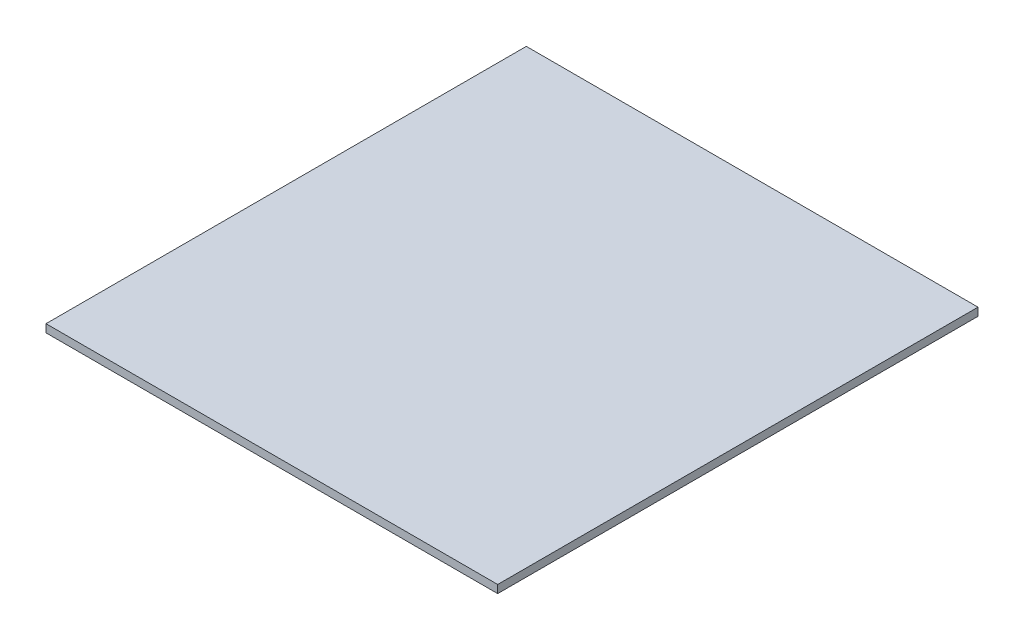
ISO-10303-21;
HEADER;
FILE_DESCRIPTION(('STEP AP214'),'2;1');
FILE_NAME('part.step','',(''),(''),'','','');
FILE_SCHEMA(('AUTOMOTIVE_DESIGN { 1 0 10303 214 1 1 1 1 }'));
ENDSEC;
DATA;
#1=APPLICATION_CONTEXT('core data for automotive mechanical design processes');
#2=APPLICATION_PROTOCOL_DEFINITION('international standard','automotive_design',2000,#1);
#3=PRODUCT_CONTEXT('',#1,'mechanical');
#4=PRODUCT('Part','Part','',(#3));
#5=PRODUCT_RELATED_PRODUCT_CATEGORY('part','',(#4));
#6=PRODUCT_DEFINITION_FORMATION('','',#4);
#7=PRODUCT_DEFINITION_CONTEXT('part definition',#1,'design');
#8=PRODUCT_DEFINITION('design','',#6,#7);
#9=PRODUCT_DEFINITION_SHAPE('','',#8);
#10=(LENGTH_UNIT() NAMED_UNIT(*) SI_UNIT(.MILLI.,.METRE.));
#11=(NAMED_UNIT(*) PLANE_ANGLE_UNIT() SI_UNIT($,.RADIAN.));
#12=(NAMED_UNIT(*) SI_UNIT($,.STERADIAN.) SOLID_ANGLE_UNIT());
#13=UNCERTAINTY_MEASURE_WITH_UNIT(LENGTH_MEASURE(1.E-05),#10,'distance_accuracy_value','');
#14=(GEOMETRIC_REPRESENTATION_CONTEXT(3) GLOBAL_UNCERTAINTY_ASSIGNED_CONTEXT((#13)) GLOBAL_UNIT_ASSIGNED_CONTEXT((#10,
#11,#12)) REPRESENTATION_CONTEXT('',''));
#15=CARTESIAN_POINT('',(0.,0.,0.));
#16=DIRECTION('',(0.,0.,1.));
#17=DIRECTION('',(1.,0.,0.));
#18=AXIS2_PLACEMENT_3D('',#15,#16,#17);
#19=CARTESIAN_POINT('',(0.,1.5875,0.));
#20=DIRECTION('',(1.,0.,0.));
#21=DIRECTION('',(0.,0.,-1.));
#22=AXIS2_PLACEMENT_3D('',#19,#20,#21);
#23=PLANE('',#22);
#24=DIRECTION('',(0.,0.,1.));
#25=VECTOR('',#24,1.);
#26=CARTESIAN_POINT('',(0.,0.,0.));
#27=LINE('',#26,#25);
#28=CARTESIAN_POINT('',(0.,0.,-95.885));
#29=VERTEX_POINT('',#28);
#30=CARTESIAN_POINT('',(0.,0.,0.));
#31=VERTEX_POINT('',#30);
#32=EDGE_CURVE('E93',#29,#31,#27,.T.);
#33=ORIENTED_EDGE('',*,*,#32,.T.);
#34=DIRECTION('',(0.,-1.,0.));
#35=VECTOR('',#34,1.);
#36=CARTESIAN_POINT('',(0.,1.5875,0.));
#37=LINE('',#36,#35);
#38=CARTESIAN_POINT('',(0.,1.5875,0.));
#39=VERTEX_POINT('',#38);
#40=EDGE_CURVE('E11',#39,#31,#37,.T.);
#41=ORIENTED_EDGE('',*,*,#40,.F.);
#42=DIRECTION('',(0.,0.,1.));
#43=VECTOR('',#42,1.);
#44=CARTESIAN_POINT('',(0.,1.5875,0.));
#45=LINE('',#44,#43);
#46=CARTESIAN_POINT('',(0.,1.5875,-95.885));
#47=VERTEX_POINT('',#46);
#48=EDGE_CURVE('E81',#47,#39,#45,.T.);
#49=ORIENTED_EDGE('',*,*,#48,.F.);
#50=DIRECTION('',(0.,-1.,0.));
#51=VECTOR('',#50,1.);
#52=CARTESIAN_POINT('',(0.,1.5875,-95.885));
#53=LINE('',#52,#51);
#54=EDGE_CURVE('E89',#47,#29,#53,.T.);
#55=ORIENTED_EDGE('',*,*,#54,.T.);
#56=EDGE_LOOP('',(#33,#41,#49,#55));
#57=FACE_BOUND('',#56,.T.);
#58=ADVANCED_FACE('F30',(#57),#23,.F.);
#59=CARTESIAN_POINT('',(0.,1.5875,0.));
#60=DIRECTION('',(0.,0.,-1.));
#61=DIRECTION('',(-1.,0.,0.));
#62=AXIS2_PLACEMENT_3D('',#59,#60,#61);
#63=PLANE('',#62);
#64=DIRECTION('',(1.,0.,0.));
#65=VECTOR('',#64,1.);
#66=CARTESIAN_POINT('',(0.,0.,0.));
#67=LINE('',#66,#65);
#68=CARTESIAN_POINT('',(90.17,0.,0.));
#69=VERTEX_POINT('',#68);
#70=EDGE_CURVE('E85',#31,#69,#67,.T.);
#71=ORIENTED_EDGE('',*,*,#70,.T.);
#72=DIRECTION('',(0.,-1.,0.));
#73=VECTOR('',#72,1.);
#74=CARTESIAN_POINT('',(90.17,1.5875,0.));
#75=LINE('',#74,#73);
#76=CARTESIAN_POINT('',(90.17,1.5875,0.));
#77=VERTEX_POINT('',#76);
#78=EDGE_CURVE('E38',#77,#69,#75,.T.);
#79=ORIENTED_EDGE('',*,*,#78,.F.);
#80=DIRECTION('',(1.,0.,0.));
#81=VECTOR('',#80,1.);
#82=CARTESIAN_POINT('',(0.,1.5875,0.));
#83=LINE('',#82,#81);
#84=EDGE_CURVE('E76',#39,#77,#83,.T.);
#85=ORIENTED_EDGE('',*,*,#84,.F.);
#86=ORIENTED_EDGE('',*,*,#40,.T.);
#87=EDGE_LOOP('',(#71,#79,#85,#86));
#88=FACE_BOUND('',#87,.T.);
#89=ADVANCED_FACE('F84',(#88),#63,.F.);
#90=CARTESIAN_POINT('',(90.17,1.5875,0.));
#91=DIRECTION('',(-1.,0.,0.));
#92=DIRECTION('',(0.,0.,1.));
#93=AXIS2_PLACEMENT_3D('',#90,#91,#92);
#94=PLANE('',#93);
#95=DIRECTION('',(0.,0.,-1.));
#96=VECTOR('',#95,1.);
#97=CARTESIAN_POINT('',(90.17,0.,0.));
#98=LINE('',#97,#96);
#99=CARTESIAN_POINT('',(90.17,0.,-95.885));
#100=VERTEX_POINT('',#99);
#101=EDGE_CURVE('E63',#69,#100,#98,.T.);
#102=ORIENTED_EDGE('',*,*,#101,.T.);
#103=DIRECTION('',(0.,-1.,0.));
#104=VECTOR('',#103,1.);
#105=CARTESIAN_POINT('',(90.17,1.5875,-95.885));
#106=LINE('',#105,#104);
#107=CARTESIAN_POINT('',(90.17,1.5875,-95.885));
#108=VERTEX_POINT('',#107);
#109=EDGE_CURVE('E86',#108,#100,#106,.T.);
#110=ORIENTED_EDGE('',*,*,#109,.F.);
#111=DIRECTION('',(0.,0.,-1.));
#112=VECTOR('',#111,1.);
#113=CARTESIAN_POINT('',(90.17,1.5875,0.));
#114=LINE('',#113,#112);
#115=EDGE_CURVE('E79',#77,#108,#114,.T.);
#116=ORIENTED_EDGE('',*,*,#115,.F.);
#117=ORIENTED_EDGE('',*,*,#78,.T.);
#118=EDGE_LOOP('',(#102,#110,#116,#117));
#119=FACE_BOUND('',#118,.T.);
#120=ADVANCED_FACE('F87',(#119),#94,.F.);
#121=CARTESIAN_POINT('',(0.,1.5875,-95.885));
#122=DIRECTION('',(0.,0.,1.));
#123=DIRECTION('',(1.,0.,0.));
#124=AXIS2_PLACEMENT_3D('',#121,#122,#123);
#125=PLANE('',#124);
#126=DIRECTION('',(-1.,0.,0.));
#127=VECTOR('',#126,1.);
#128=CARTESIAN_POINT('',(0.,0.,-95.885));
#129=LINE('',#128,#127);
#130=EDGE_CURVE('E69',#100,#29,#129,.T.);
#131=ORIENTED_EDGE('',*,*,#130,.T.);
#132=ORIENTED_EDGE('',*,*,#54,.F.);
#133=DIRECTION('',(-1.,0.,0.));
#134=VECTOR('',#133,1.);
#135=CARTESIAN_POINT('',(0.,1.5875,-95.885));
#136=LINE('',#135,#134);
#137=EDGE_CURVE('E46',#108,#47,#136,.T.);
#138=ORIENTED_EDGE('',*,*,#137,.F.);
#139=ORIENTED_EDGE('',*,*,#109,.T.);
#140=EDGE_LOOP('',(#131,#132,#138,#139));
#141=FACE_BOUND('',#140,.T.);
#142=ADVANCED_FACE('F100',(#141),#125,.F.);
#143=CARTESIAN_POINT('',(0.,1.5875,-95.885));
#144=DIRECTION('',(0.,-1.,0.));
#145=DIRECTION('',(0.,0.,-1.));
#146=AXIS2_PLACEMENT_3D('',#143,#144,#145);
#147=PLANE('',#146);
#148=ORIENTED_EDGE('',*,*,#48,.T.);
#149=ORIENTED_EDGE('',*,*,#84,.T.);
#150=ORIENTED_EDGE('',*,*,#115,.T.);
#151=ORIENTED_EDGE('',*,*,#137,.T.);
#152=EDGE_LOOP('',(#148,#149,#150,#151));
#153=FACE_BOUND('',#152,.T.);
#154=ADVANCED_FACE('F77',(#153),#147,.F.);
#155=CARTESIAN_POINT('',(0.,0.,-95.885));
#156=DIRECTION('',(0.,-1.,0.));
#157=DIRECTION('',(0.,0.,-1.));
#158=AXIS2_PLACEMENT_3D('',#155,#156,#157);
#159=PLANE('',#158);
#160=ORIENTED_EDGE('',*,*,#32,.F.);
#161=ORIENTED_EDGE('',*,*,#130,.F.);
#162=ORIENTED_EDGE('',*,*,#101,.F.);
#163=ORIENTED_EDGE('',*,*,#70,.F.);
#164=EDGE_LOOP('',(#160,#161,#162,#163));
#165=FACE_BOUND('',#164,.T.);
#166=ADVANCED_FACE('F103',(#165),#159,.T.);
#167=CLOSED_SHELL('',(#58,#89,#120,#142,#154,#166));
#168=MANIFOLD_SOLID_BREP('B2',#167);
#169=ADVANCED_BREP_SHAPE_REPRESENTATION('',(#18,#168),#14);
#170=SHAPE_DEFINITION_REPRESENTATION(#9,#169);
ENDSEC;
END-ISO-10303-21;
